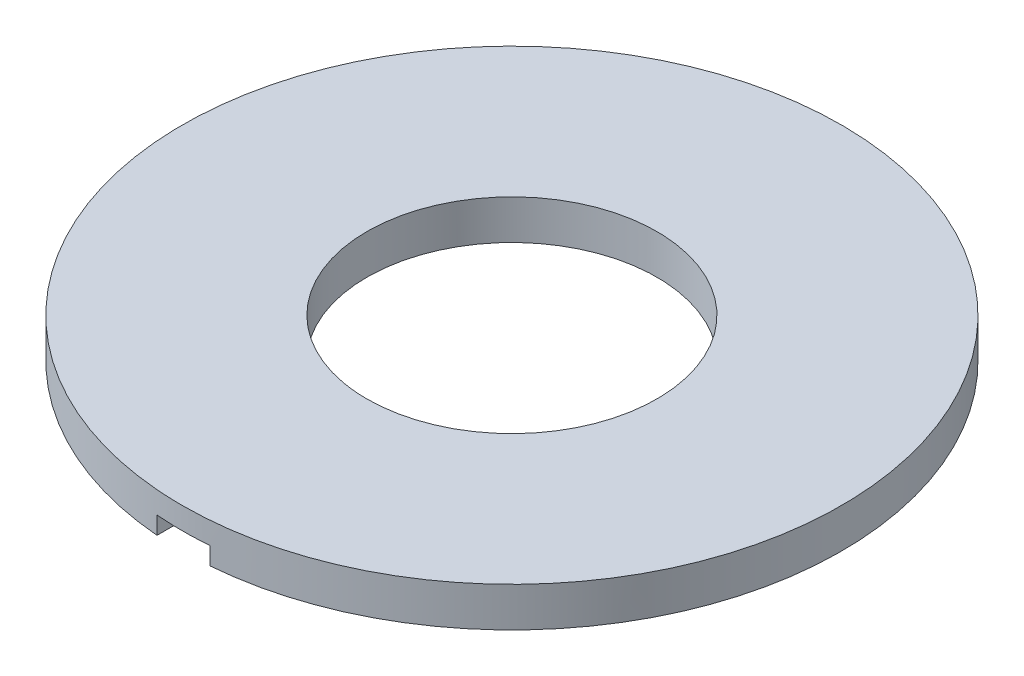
from build123d import *

# Parameters (mm, degrees)
SKETCH1_R          = 2.5
SKETCH1_R_2        = 1.1
EXTRUDE1_DEPTH     = 0.3
SKETCH2_W          = 0.4
SKETCH2_H          = 2.8
CUT_EXTRUDE1_DEPTH = 0.133333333


with BuildPart() as part:
    # Sketch1 → Extrude1 (new body)
    with BuildSketch(Plane(origin=(0, 0, 0), x_dir=(1, 0, 0), z_dir=(0, 1, 0))):
        with Locations(Location((0, 0, 0), (0, 0, 270))):
            Circle(SKETCH1_R)
        with Locations(Location((0, 0, 0), (0, 0, 270))):
            Circle(SKETCH1_R_2, mode=Mode.SUBTRACT)
    extrude(amount=EXTRUDE1_DEPTH)

    # Sketch2 → Cut-Extrude1 (cut)
    with BuildSketch(Plane.XZ):
        with Locations((0, 1.1)):
            Rectangle(SKETCH2_W, SKETCH2_H)
    extrude(amount=-CUT_EXTRUDE1_DEPTH, mode=Mode.SUBTRACT)


solid = part.part
